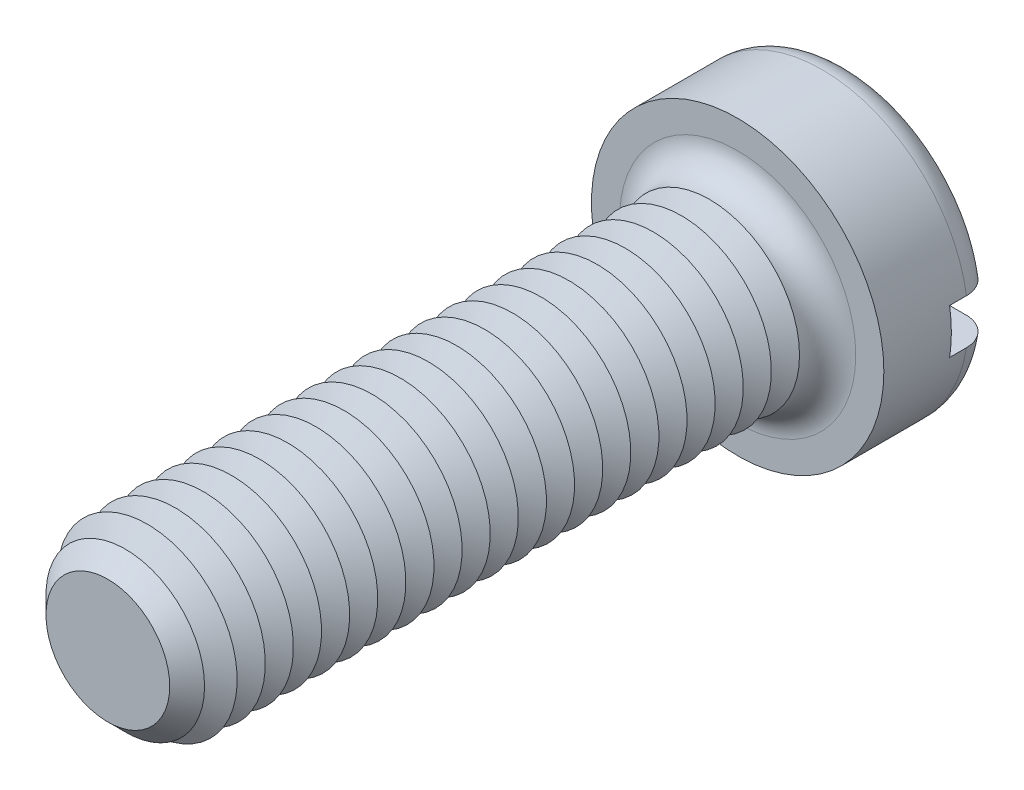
from build123d import *

# Parameters (mm, degrees)
SKETCH3_R           = 6.5
BOSS_EXTRUDE2_DEPTH = 5
SKETCH4_R           = 4
BOSS_EXTRUDE3_DEPTH = 28
FILLET1_R           = 1.25
CHAMFER1_SIZE       = 1.25
LPATTERN1_COUNT     = 21
LPATTERN1_PITCH     = 1.25
SKETCH8_W           = 13
SKETCH8_H           = 2
CUT_EXTRUDE1_DEPTH  = 2


with BuildPart() as part:
    # Sketch3 → Boss-Extrude2 (new body)
    with BuildSketch(Plane.XY):
        Circle(SKETCH3_R)
    extrude(amount=-BOSS_EXTRUDE2_DEPTH)

    # Sketch4 → Boss-Extrude3 (add)
    with BuildSketch(Plane.XY):
        Circle(SKETCH4_R)
    extrude(amount=BOSS_EXTRUDE3_DEPTH)

    # Fillet1
    fillet1_edges = [part.edges().sort_by_distance(p)[0] for p in [
        (-6.5, 0, -5),
        (-4, 0, 0),
    ]]
    fillet(fillet1_edges, radius=FILLET1_R)

    # Chamfer1
    chamfer1_edges = [part.edges().sort_by_distance(p)[0] for p in [
        (-4, 0, 28),
    ]]
    chamfer(chamfer1_edges, length=CHAMFER1_SIZE)

    # Sketch6 → Cut-Revolve1 (revolve, cut)
    with BuildSketch(Plane(origin=(0, 0, 0), x_dir=(0, 0, -1), z_dir=(1, 0, 0)), mode=Mode.PRIVATE) as cut_revolve1_sk:
        Polygon((-1.25, 4), (-1.875, 2.917468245), (-2.5, 4), align=None)
    cut_revolve1 = revolve(cut_revolve1_sk.sketch.rotate(Axis((0, 0, -1.694361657), (0, 0, 1)), 90), axis=Axis((0, 0, -1.694361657), (0, 0, 1)), mode=Mode.SUBTRACT)

    # LPattern1: Cut-Revolve1 ×21
    with Locations(*[(0, 0, i * LPATTERN1_PITCH) for i in range(1, LPATTERN1_COUNT)]):
        add(cut_revolve1, mode=Mode.SUBTRACT)

    # Sketch8 → Cut-Extrude1 (cut)
    with BuildSketch(Plane(origin=(0, 0, -5), x_dir=(-1, 0, 0), z_dir=(0, 0, -1))):
        Rectangle(SKETCH8_W, SKETCH8_H)
    extrude(amount=-CUT_EXTRUDE1_DEPTH, mode=Mode.SUBTRACT)


solid = part.part
